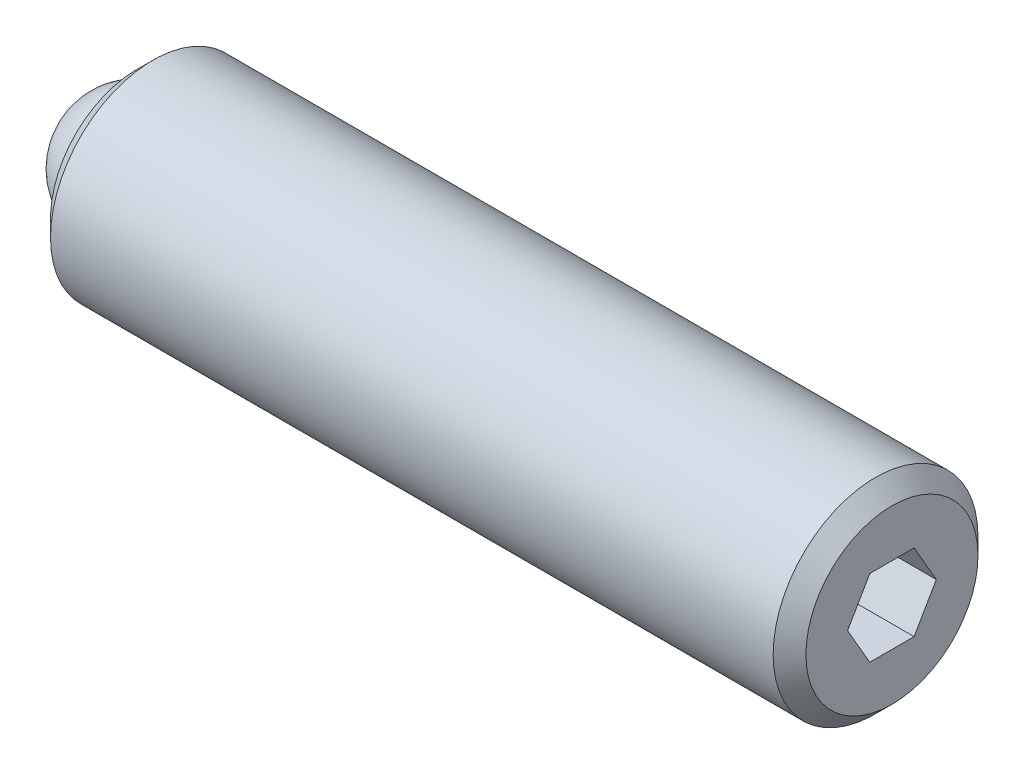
from build123d import *

# Parameters (mm, degrees)
SKETCH2_R           = 3.175
BOSS_EXTRUDE1_DEPTH = 23.415625
CHAMFER1_SIZE       = 0.508
CHAMFER2_SIZE       = 0.508
CUT_EXTRUDE2_DEPTH  = 2.286
SKETCH3_R           = 1.9812
CUT_EXTRUDE3_DEPTH  = 1.984375


with BuildPart() as part:
    # Sketch2 → Boss-Extrude1 (new body)
    with BuildSketch(Plane(origin=(0, 0, 0), x_dir=(0, 0, -1), z_dir=(1, 0, 0))):
        with Locations(Location((0, 0, 0), (0, 0, 180))):
            Circle(SKETCH2_R)
    extrude(amount=BOSS_EXTRUDE1_DEPTH)

    # Chamfer1
    chamfer1_edges = [part.edges().sort_by_distance(p)[0] for p in [
        (0, 0, -3.175),
    ]]
    chamfer(chamfer1_edges, length=CHAMFER1_SIZE)

    # Chamfer2
    chamfer2_edges = [part.edges().sort_by_distance(p)[0] for p in [
        (23.415625, 0, -3.175),
    ]]
    chamfer(chamfer2_edges, length=CHAMFER2_SIZE)

    # Sketch4 → Cut-Extrude2 (cut)
    with BuildSketch(Plane(origin=(23.415625, 0, 0), x_dir=(0, 0, -1), z_dir=(1, 0, 0))):
        Polygon((1.374815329, 0), (0.687407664, 1.190625), (-0.687407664, 1.190625), (-1.374815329, 0), (-0.687407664, -1.190625), (0.687407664, -1.190625), align=None)
    extrude(amount=-CUT_EXTRUDE2_DEPTH, mode=Mode.SUBTRACT)

    # Sketch3 → Cut-Extrude3 (cut)
    with BuildSketch(Plane.ZY):
        Circle(SKETCH3_R)
    extrude(amount=-CUT_EXTRUDE3_DEPTH, mode=Mode.SUBTRACT)


with BuildPart() as body_2:
    # Sketch5 → Revolve1 (revolve)
    with BuildSketch(Plane.ZY):
        with BuildLine():
            Line((0, 0), (0, -1.984375))
            ThreePointArc((0, -1.984375), (-1.984375, 0), (0, 1.984375))
            Line((0, 1.984375), (0, 0))
        make_face()
    revolve(axis=Axis((0, 0, 0), (0, 1, 0)))


solid = Compound([part.part, body_2.part])
